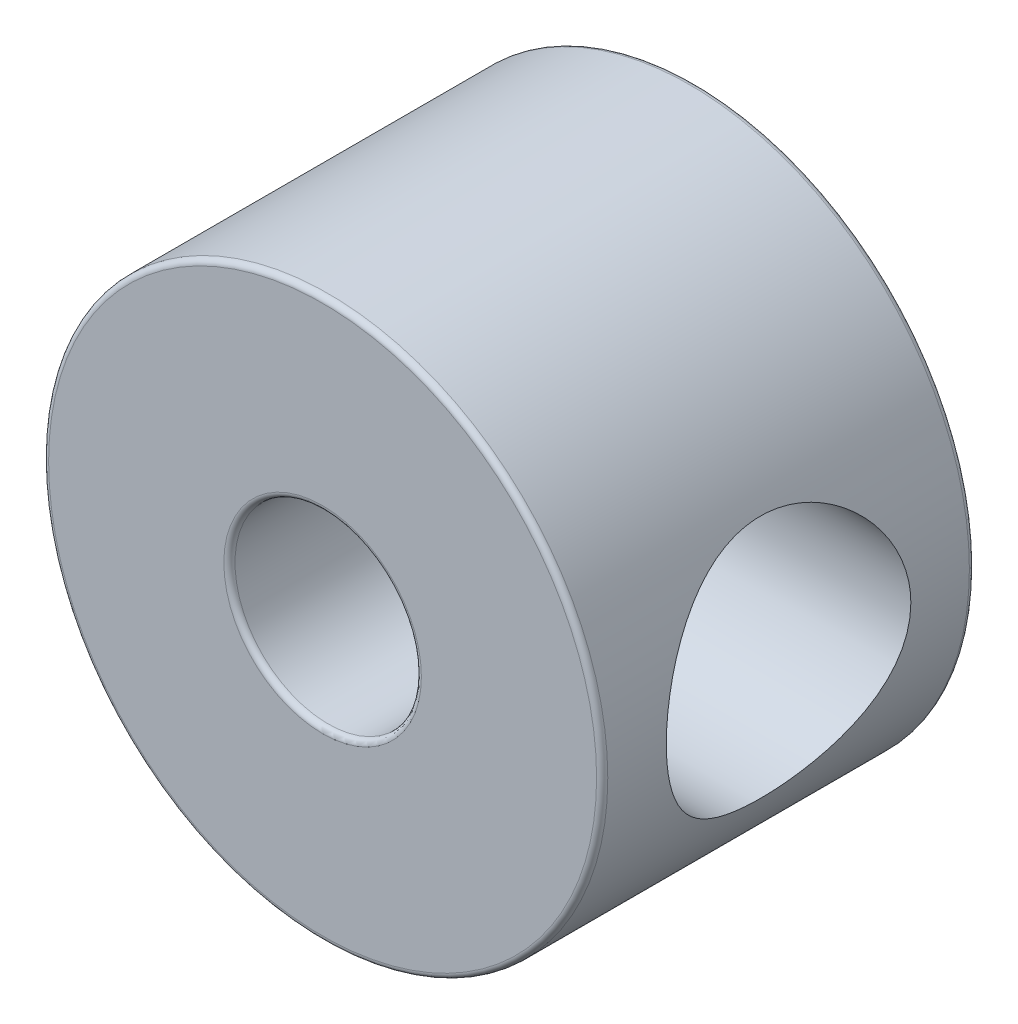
from build123d import *

# Parameters (mm, degrees)
SKETCH1_R          = 4.7625
SKETCH1_R_2        = 1.5875
EXTRUDE1_DEPTH     = 6.35
CUT_EXTRUDE1_START = -4.7625
SKETCH2_R          = 2.0828
CUT_EXTRUDE1_DEPTH = 4.7625
FILLET1_R          = 0.09525


with BuildPart() as part:
    # Sketch1 → Extrude1 (new body)
    with BuildSketch(Plane.XY):
        Circle(SKETCH1_R)
        Circle(SKETCH1_R_2, mode=Mode.SUBTRACT)
    extrude(amount=EXTRUDE1_DEPTH)

    # Sketch2 → Cut-Extrude1 (cut)
    with BuildSketch(Plane(origin=(4.7625, 0, 0), x_dir=(0, 0, -1), z_dir=(1, 0, 0)).offset(CUT_EXTRUDE1_START)):
        with Locations((-3.175, 0)):
            Circle(SKETCH2_R)
    extrude(amount=CUT_EXTRUDE1_DEPTH, mode=Mode.SUBTRACT)

    # Fillet1
    fillet1_edges = [part.edges().sort_by_distance(p)[0] for p in [
        (-4.7625, 0, 0),
        (-4.7625, 0, 6.35),
        (-1.5875, 0, 0),
        (-1.5875, 0, 6.35),
    ]]
    fillet(fillet1_edges, radius=FILLET1_R)


solid = part.part
